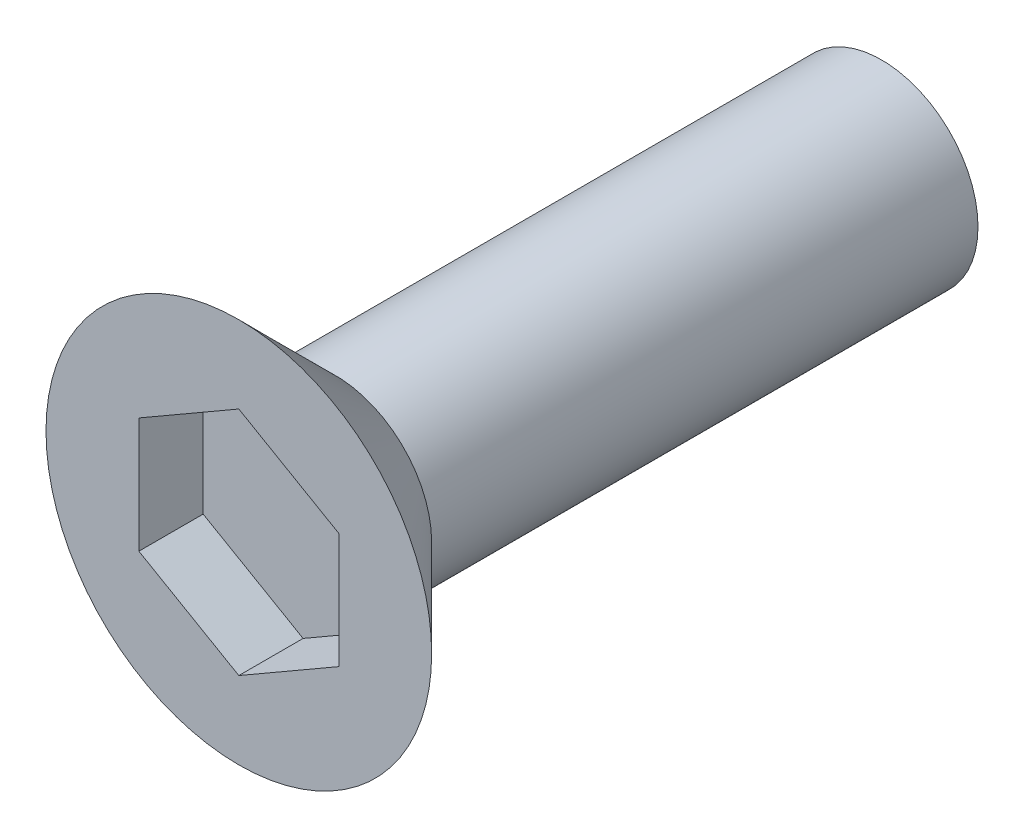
ISO-10303-21;
HEADER;
FILE_DESCRIPTION(('STEP AP214'),'2;1');
FILE_NAME('part.step','',(''),(''),'','','');
FILE_SCHEMA(('AUTOMOTIVE_DESIGN { 1 0 10303 214 1 1 1 1 }'));
ENDSEC;
DATA;
#1=APPLICATION_CONTEXT('core data for automotive mechanical design processes');
#2=APPLICATION_PROTOCOL_DEFINITION('international standard','automotive_design',2000,#1);
#3=PRODUCT_CONTEXT('',#1,'mechanical');
#4=PRODUCT('Part','Part','',(#3));
#5=PRODUCT_RELATED_PRODUCT_CATEGORY('part','',(#4));
#6=PRODUCT_DEFINITION_FORMATION('','',#4);
#7=PRODUCT_DEFINITION_CONTEXT('part definition',#1,'design');
#8=PRODUCT_DEFINITION('design','',#6,#7);
#9=PRODUCT_DEFINITION_SHAPE('','',#8);
#10=(LENGTH_UNIT() NAMED_UNIT(*) SI_UNIT(.MILLI.,.METRE.));
#11=(NAMED_UNIT(*) PLANE_ANGLE_UNIT() SI_UNIT($,.RADIAN.));
#12=(NAMED_UNIT(*) SI_UNIT($,.STERADIAN.) SOLID_ANGLE_UNIT());
#13=UNCERTAINTY_MEASURE_WITH_UNIT(LENGTH_MEASURE(1.E-05),#10,'distance_accuracy_value','');
#14=(GEOMETRIC_REPRESENTATION_CONTEXT(3) GLOBAL_UNCERTAINTY_ASSIGNED_CONTEXT((#13)) GLOBAL_UNIT_ASSIGNED_CONTEXT((#10,
#11,#12)) REPRESENTATION_CONTEXT('',''));
#15=CARTESIAN_POINT('',(0.,0.,0.));
#16=DIRECTION('',(0.,0.,1.));
#17=DIRECTION('',(1.,0.,0.));
#18=AXIS2_PLACEMENT_3D('',#15,#16,#17);
#19=CARTESIAN_POINT('',(0.,0.,30.));
#20=DIRECTION('',(0.,0.,-1.));
#21=DIRECTION('',(-1.,0.,0.));
#22=AXIS2_PLACEMENT_3D('',#19,#20,#21);
#23=CYLINDRICAL_SURFACE('',#22,1.5);
#24=CARTESIAN_POINT('',(0.,0.,21.75));
#25=DIRECTION('',(0.,0.,1.));
#26=DIRECTION('',(1.,0.,0.));
#27=AXIS2_PLACEMENT_3D('',#24,#25,#26);
#28=CIRCLE('',#27,1.5);
#29=CARTESIAN_POINT('',(1.5,0.,21.75));
#30=VERTEX_POINT('',#29);
#31=EDGE_CURVE('E21',#30,#30,#28,.F.);
#32=ORIENTED_EDGE('',*,*,#31,.F.);
#33=EDGE_LOOP('',(#32));
#34=FACE_BOUND('',#33,.T.);
#35=CARTESIAN_POINT('',(0.,0.,30.25));
#36=DIRECTION('',(0.,0.,1.));
#37=DIRECTION('',(1.,0.,0.));
#38=AXIS2_PLACEMENT_3D('',#35,#36,#37);
#39=CIRCLE('',#38,1.5);
#40=CARTESIAN_POINT('',(1.5,0.,30.25));
#41=VERTEX_POINT('',#40);
#42=EDGE_CURVE('E11',#41,#41,#39,.F.);
#43=ORIENTED_EDGE('',*,*,#42,.T.);
#44=EDGE_LOOP('',(#43));
#45=FACE_BOUND('',#44,.T.);
#46=ADVANCED_FACE('F17',(#34,#45),#23,.T.);
#47=CARTESIAN_POINT('',(0.,0.,31.75));
#48=DIRECTION('',(0.,0.,-1.));
#49=DIRECTION('',(-1.,0.,0.));
#50=AXIS2_PLACEMENT_3D('',#47,#48,#49);
#51=PLANE('',#50);
#52=DIRECTION('',(-0.866025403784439,0.5,0.));
#53=VECTOR('',#52,1.);
#54=CARTESIAN_POINT('',(1.555,0.897779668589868,31.75));
#55=LINE('',#54,#53);
#56=CARTESIAN_POINT('',(1.555,0.897779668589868,31.75));
#57=VERTEX_POINT('',#56);
#58=CARTESIAN_POINT('',(0.,1.79555933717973,31.75));
#59=VERTEX_POINT('',#58);
#60=EDGE_CURVE('E107',#57,#59,#55,.T.);
#61=ORIENTED_EDGE('',*,*,#60,.F.);
#62=DIRECTION('',(0.,1.,0.));
#63=VECTOR('',#62,1.);
#64=CARTESIAN_POINT('',(1.555,-0.897779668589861,31.75));
#65=LINE('',#64,#63);
#66=CARTESIAN_POINT('',(1.555,-0.897779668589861,31.75));
#67=VERTEX_POINT('',#66);
#68=EDGE_CURVE('E112',#67,#57,#65,.T.);
#69=ORIENTED_EDGE('',*,*,#68,.F.);
#70=DIRECTION('',(0.866025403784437,0.5,0.));
#71=VECTOR('',#70,1.);
#72=CARTESIAN_POINT('',(0.,-1.79555933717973,31.75));
#73=LINE('',#72,#71);
#74=CARTESIAN_POINT('',(0.,-1.79555933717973,31.75));
#75=VERTEX_POINT('',#74);
#76=EDGE_CURVE('E106',#75,#67,#73,.T.);
#77=ORIENTED_EDGE('',*,*,#76,.F.);
#78=DIRECTION('',(0.86602540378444,-0.5,0.));
#79=VECTOR('',#78,1.);
#80=CARTESIAN_POINT('',(-1.555,-0.897779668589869,31.75));
#81=LINE('',#80,#79);
#82=CARTESIAN_POINT('',(-1.555,-0.897779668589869,31.75));
#83=VERTEX_POINT('',#82);
#84=EDGE_CURVE('E33',#83,#75,#81,.T.);
#85=ORIENTED_EDGE('',*,*,#84,.F.);
#86=DIRECTION('',(0.,-1.,0.));
#87=VECTOR('',#86,1.);
#88=CARTESIAN_POINT('',(-1.555,0.897779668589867,31.75));
#89=LINE('',#88,#87);
#90=CARTESIAN_POINT('',(-1.555,0.897779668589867,31.75));
#91=VERTEX_POINT('',#90);
#92=EDGE_CURVE('E82',#91,#83,#89,.T.);
#93=ORIENTED_EDGE('',*,*,#92,.F.);
#94=DIRECTION('',(-0.866025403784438,-0.5,0.));
#95=VECTOR('',#94,1.);
#96=CARTESIAN_POINT('',(0.,1.79555933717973,31.75));
#97=LINE('',#96,#95);
#98=EDGE_CURVE('E111',#59,#91,#97,.T.);
#99=ORIENTED_EDGE('',*,*,#98,.F.);
#100=EDGE_LOOP('',(#61,#69,#77,#85,#93,#99));
#101=FACE_BOUND('',#100,.T.);
#102=CARTESIAN_POINT('',(0.,0.,31.75));
#103=DIRECTION('',(0.,0.,-1.));
#104=DIRECTION('',(1.,0.,0.));
#105=AXIS2_PLACEMENT_3D('',#102,#103,#104);
#106=CIRCLE('',#105,3.);
#107=CARTESIAN_POINT('',(3.,0.,31.75));
#108=VERTEX_POINT('',#107);
#109=EDGE_CURVE('E26',#108,#108,#106,.T.);
#110=ORIENTED_EDGE('',*,*,#109,.F.);
#111=EDGE_LOOP('',(#110));
#112=FACE_BOUND('',#111,.T.);
#113=ADVANCED_FACE('F135',(#101,#112),#51,.F.);
#114=CARTESIAN_POINT('',(0.,0.,30.));
#115=DIRECTION('',(0.,0.,1.));
#116=DIRECTION('',(1.,0.,0.));
#117=AXIS2_PLACEMENT_3D('',#114,#115,#116);
#118=CONICAL_SURFACE('',#117,1.25,0.785398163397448);
#119=ORIENTED_EDGE('',*,*,#109,.T.);
#120=EDGE_LOOP('',(#119));
#121=FACE_BOUND('',#120,.T.);
#122=ORIENTED_EDGE('',*,*,#42,.F.);
#123=EDGE_LOOP('',(#122));
#124=FACE_BOUND('',#123,.T.);
#125=ADVANCED_FACE('F19',(#121,#124),#118,.T.);
#126=CARTESIAN_POINT('',(1.555,-0.897779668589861,30.75));
#127=DIRECTION('',(1.,0.,0.));
#128=DIRECTION('',(0.,1.,0.));
#129=AXIS2_PLACEMENT_3D('',#126,#127,#128);
#130=PLANE('',#129);
#131=ORIENTED_EDGE('',*,*,#68,.T.);
#132=DIRECTION('',(0.,0.,1.));
#133=VECTOR('',#132,1.);
#134=CARTESIAN_POINT('',(1.555,0.897779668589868,30.75));
#135=LINE('',#134,#133);
#136=CARTESIAN_POINT('',(1.555,0.897779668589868,30.75));
#137=VERTEX_POINT('',#136);
#138=EDGE_CURVE('E66',#137,#57,#135,.T.);
#139=ORIENTED_EDGE('',*,*,#138,.F.);
#140=DIRECTION('',(0.,1.,0.));
#141=VECTOR('',#140,1.);
#142=CARTESIAN_POINT('',(1.555,-0.897779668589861,30.75));
#143=LINE('',#142,#141);
#144=CARTESIAN_POINT('',(1.555,-0.897779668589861,30.75));
#145=VERTEX_POINT('',#144);
#146=EDGE_CURVE('E103',#145,#137,#143,.T.);
#147=ORIENTED_EDGE('',*,*,#146,.F.);
#148=DIRECTION('',(0.,0.,1.));
#149=VECTOR('',#148,1.);
#150=CARTESIAN_POINT('',(1.555,-0.897779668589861,30.75));
#151=LINE('',#150,#149);
#152=EDGE_CURVE('E42',#145,#67,#151,.T.);
#153=ORIENTED_EDGE('',*,*,#152,.T.);
#154=EDGE_LOOP('',(#131,#139,#147,#153));
#155=FACE_BOUND('',#154,.T.);
#156=ADVANCED_FACE('F145',(#155),#130,.F.);
#157=CARTESIAN_POINT('',(1.555,0.897779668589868,30.75));
#158=DIRECTION('',(0.5,0.866025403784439,0.));
#159=DIRECTION('',(-0.866025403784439,0.5,0.));
#160=AXIS2_PLACEMENT_3D('',#157,#158,#159);
#161=PLANE('',#160);
#162=ORIENTED_EDGE('',*,*,#60,.T.);
#163=DIRECTION('',(0.,0.,1.));
#164=VECTOR('',#163,1.);
#165=CARTESIAN_POINT('',(0.,1.79555933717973,30.75));
#166=LINE('',#165,#164);
#167=CARTESIAN_POINT('',(0.,1.79555933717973,30.75));
#168=VERTEX_POINT('',#167);
#169=EDGE_CURVE('E127',#168,#59,#166,.T.);
#170=ORIENTED_EDGE('',*,*,#169,.F.);
#171=DIRECTION('',(-0.866025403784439,0.5,0.));
#172=VECTOR('',#171,1.);
#173=CARTESIAN_POINT('',(1.555,0.897779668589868,30.75));
#174=LINE('',#173,#172);
#175=EDGE_CURVE('E105',#137,#168,#174,.T.);
#176=ORIENTED_EDGE('',*,*,#175,.F.);
#177=ORIENTED_EDGE('',*,*,#138,.T.);
#178=EDGE_LOOP('',(#162,#170,#176,#177));
#179=FACE_BOUND('',#178,.T.);
#180=ADVANCED_FACE('F151',(#179),#161,.F.);
#181=CARTESIAN_POINT('',(0.,1.79555933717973,30.75));
#182=DIRECTION('',(-0.5,0.866025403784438,0.));
#183=DIRECTION('',(-0.866025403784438,-0.5,0.));
#184=AXIS2_PLACEMENT_3D('',#181,#182,#183);
#185=PLANE('',#184);
#186=ORIENTED_EDGE('',*,*,#98,.T.);
#187=DIRECTION('',(0.,0.,1.));
#188=VECTOR('',#187,1.);
#189=CARTESIAN_POINT('',(-1.555,0.897779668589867,30.75));
#190=LINE('',#189,#188);
#191=CARTESIAN_POINT('',(-1.555,0.897779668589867,30.75));
#192=VERTEX_POINT('',#191);
#193=EDGE_CURVE('E84',#192,#91,#190,.T.);
#194=ORIENTED_EDGE('',*,*,#193,.F.);
#195=DIRECTION('',(-0.866025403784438,-0.5,0.));
#196=VECTOR('',#195,1.);
#197=CARTESIAN_POINT('',(0.,1.79555933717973,30.75));
#198=LINE('',#197,#196);
#199=EDGE_CURVE('E95',#168,#192,#198,.T.);
#200=ORIENTED_EDGE('',*,*,#199,.F.);
#201=ORIENTED_EDGE('',*,*,#169,.T.);
#202=EDGE_LOOP('',(#186,#194,#200,#201));
#203=FACE_BOUND('',#202,.T.);
#204=ADVANCED_FACE('F154',(#203),#185,.F.);
#205=CARTESIAN_POINT('',(-1.555,0.897779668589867,30.75));
#206=DIRECTION('',(-1.,0.,0.));
#207=DIRECTION('',(0.,-1.,0.));
#208=AXIS2_PLACEMENT_3D('',#205,#206,#207);
#209=PLANE('',#208);
#210=ORIENTED_EDGE('',*,*,#92,.T.);
#211=DIRECTION('',(0.,0.,1.));
#212=VECTOR('',#211,1.);
#213=CARTESIAN_POINT('',(-1.555,-0.897779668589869,30.75));
#214=LINE('',#213,#212);
#215=CARTESIAN_POINT('',(-1.555,-0.897779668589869,30.75));
#216=VERTEX_POINT('',#215);
#217=EDGE_CURVE('E77',#216,#83,#214,.T.);
#218=ORIENTED_EDGE('',*,*,#217,.F.);
#219=DIRECTION('',(0.,-1.,0.));
#220=VECTOR('',#219,1.);
#221=CARTESIAN_POINT('',(-1.555,0.897779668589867,30.75));
#222=LINE('',#221,#220);
#223=EDGE_CURVE('E80',#192,#216,#222,.T.);
#224=ORIENTED_EDGE('',*,*,#223,.F.);
#225=ORIENTED_EDGE('',*,*,#193,.T.);
#226=EDGE_LOOP('',(#210,#218,#224,#225));
#227=FACE_BOUND('',#226,.T.);
#228=ADVANCED_FACE('F79',(#227),#209,.F.);
#229=CARTESIAN_POINT('',(-1.555,-0.897779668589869,30.75));
#230=DIRECTION('',(-0.5,-0.86602540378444,0.));
#231=DIRECTION('',(0.86602540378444,-0.5,0.));
#232=AXIS2_PLACEMENT_3D('',#229,#230,#231);
#233=PLANE('',#232);
#234=ORIENTED_EDGE('',*,*,#84,.T.);
#235=DIRECTION('',(0.,0.,1.));
#236=VECTOR('',#235,1.);
#237=CARTESIAN_POINT('',(0.,-1.79555933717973,30.75));
#238=LINE('',#237,#236);
#239=CARTESIAN_POINT('',(0.,-1.79555933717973,30.75));
#240=VERTEX_POINT('',#239);
#241=EDGE_CURVE('E85',#240,#75,#238,.T.);
#242=ORIENTED_EDGE('',*,*,#241,.F.);
#243=DIRECTION('',(0.86602540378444,-0.5,0.));
#244=VECTOR('',#243,1.);
#245=CARTESIAN_POINT('',(-1.555,-0.897779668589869,30.75));
#246=LINE('',#245,#244);
#247=EDGE_CURVE('E92',#216,#240,#246,.T.);
#248=ORIENTED_EDGE('',*,*,#247,.F.);
#249=ORIENTED_EDGE('',*,*,#217,.T.);
#250=EDGE_LOOP('',(#234,#242,#248,#249));
#251=FACE_BOUND('',#250,.T.);
#252=ADVANCED_FACE('F97',(#251),#233,.F.);
#253=CARTESIAN_POINT('',(0.,-1.79555933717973,30.75));
#254=DIRECTION('',(0.5,-0.866025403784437,0.));
#255=DIRECTION('',(0.866025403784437,0.5,0.));
#256=AXIS2_PLACEMENT_3D('',#253,#254,#255);
#257=PLANE('',#256);
#258=ORIENTED_EDGE('',*,*,#76,.T.);
#259=ORIENTED_EDGE('',*,*,#152,.F.);
#260=DIRECTION('',(0.866025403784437,0.5,0.));
#261=VECTOR('',#260,1.);
#262=CARTESIAN_POINT('',(0.,-1.79555933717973,30.75));
#263=LINE('',#262,#261);
#264=EDGE_CURVE('E98',#240,#145,#263,.T.);
#265=ORIENTED_EDGE('',*,*,#264,.F.);
#266=ORIENTED_EDGE('',*,*,#241,.T.);
#267=EDGE_LOOP('',(#258,#259,#265,#266));
#268=FACE_BOUND('',#267,.T.);
#269=ADVANCED_FACE('F163',(#268),#257,.F.);
#270=CARTESIAN_POINT('',(0.,0.,30.75));
#271=DIRECTION('',(0.,0.,1.));
#272=DIRECTION('',(1.,0.,0.));
#273=AXIS2_PLACEMENT_3D('',#270,#271,#272);
#274=PLANE('',#273);
#275=ORIENTED_EDGE('',*,*,#146,.T.);
#276=ORIENTED_EDGE('',*,*,#175,.T.);
#277=ORIENTED_EDGE('',*,*,#199,.T.);
#278=ORIENTED_EDGE('',*,*,#223,.T.);
#279=ORIENTED_EDGE('',*,*,#247,.T.);
#280=ORIENTED_EDGE('',*,*,#264,.T.);
#281=EDGE_LOOP('',(#275,#276,#277,#278,#279,#280));
#282=FACE_BOUND('',#281,.T.);
#283=ADVANCED_FACE('F91',(#282),#274,.T.);
#284=CARTESIAN_POINT('',(0.,0.,21.75));
#285=DIRECTION('',(0.,0.,1.));
#286=DIRECTION('',(1.,0.,0.));
#287=AXIS2_PLACEMENT_3D('',#284,#285,#286);
#288=PLANE('',#287);
#289=ORIENTED_EDGE('',*,*,#31,.T.);
#290=EDGE_LOOP('',(#289));
#291=FACE_BOUND('',#290,.T.);
#292=ADVANCED_FACE('F168',(#291),#288,.F.);
#293=CLOSED_SHELL('',(#46,#113,#125,#156,#180,#204,#228,#252,#269,#283,#292));
#294=MANIFOLD_SOLID_BREP('B1',#293);
#295=ADVANCED_BREP_SHAPE_REPRESENTATION('',(#18,#294),#14);
#296=SHAPE_DEFINITION_REPRESENTATION(#9,#295);
ENDSEC;
END-ISO-10303-21;
